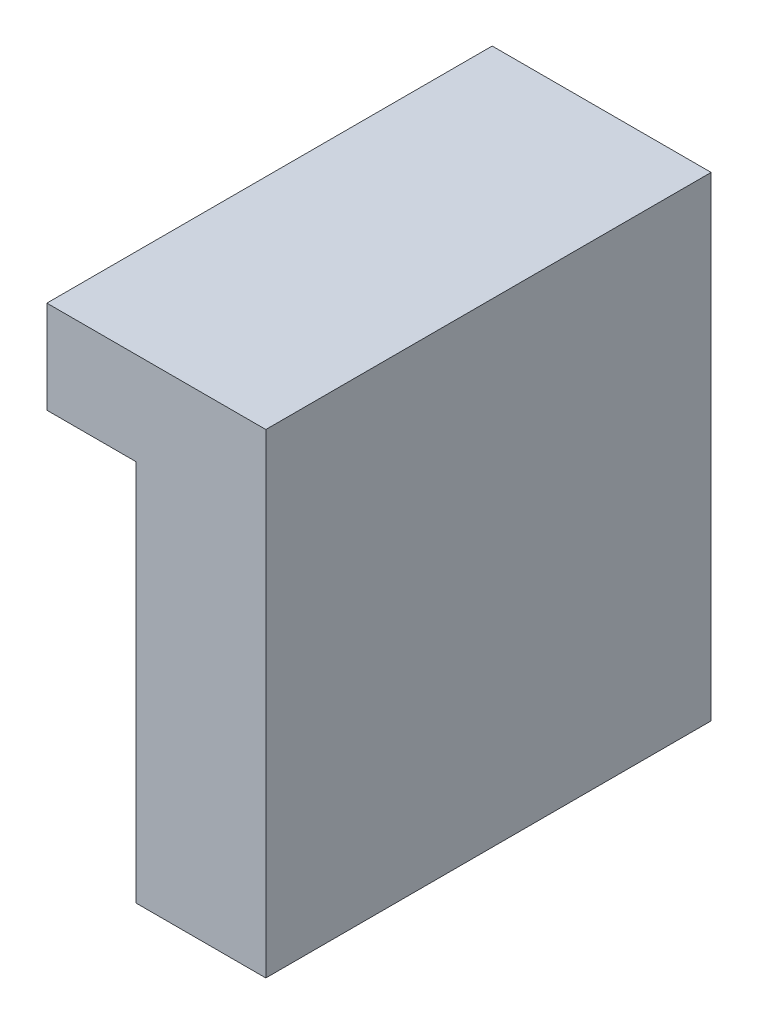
from build123d import *

# Parameters (mm, degrees)
AUFSATZ_LINEAR_AUSTRAGEN1_DEPTH = 120


with BuildPart() as part:
    # Skizze1 → Aufsatz-Linear austragen1 (new body)
    with BuildSketch(Plane.XY):
        Polygon((0, 0), (0, 128), (-59, 128), (-59, 103), (-35, 103), (-35, 0), align=None)
    extrude(amount=-AUFSATZ_LINEAR_AUSTRAGEN1_DEPTH)


solid = part.part
